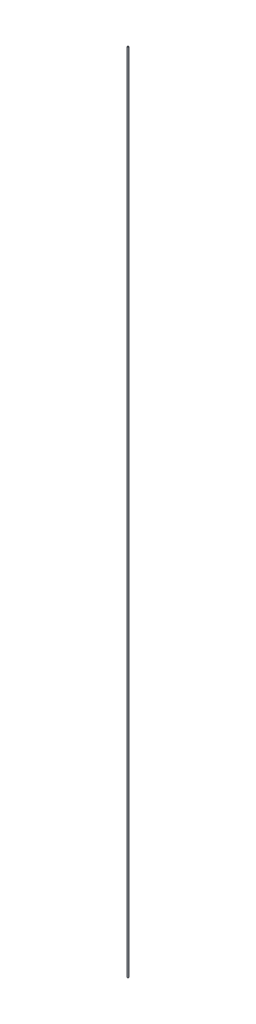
ISO-10303-21;
HEADER;
FILE_DESCRIPTION(('STEP AP214'),'2;1');
FILE_NAME('part.step','',(''),(''),'','','');
FILE_SCHEMA(('AUTOMOTIVE_DESIGN { 1 0 10303 214 1 1 1 1 }'));
ENDSEC;
DATA;
#1=APPLICATION_CONTEXT('core data for automotive mechanical design processes');
#2=APPLICATION_PROTOCOL_DEFINITION('international standard','automotive_design',2000,#1);
#3=PRODUCT_CONTEXT('',#1,'mechanical');
#4=PRODUCT('Part','Part','',(#3));
#5=PRODUCT_RELATED_PRODUCT_CATEGORY('part','',(#4));
#6=PRODUCT_DEFINITION_FORMATION('','',#4);
#7=PRODUCT_DEFINITION_CONTEXT('part definition',#1,'design');
#8=PRODUCT_DEFINITION('design','',#6,#7);
#9=PRODUCT_DEFINITION_SHAPE('','',#8);
#10=(LENGTH_UNIT() NAMED_UNIT(*) SI_UNIT(.MILLI.,.METRE.));
#11=(NAMED_UNIT(*) PLANE_ANGLE_UNIT() SI_UNIT($,.RADIAN.));
#12=(NAMED_UNIT(*) SI_UNIT($,.STERADIAN.) SOLID_ANGLE_UNIT());
#13=UNCERTAINTY_MEASURE_WITH_UNIT(LENGTH_MEASURE(1.E-05),#10,'distance_accuracy_value','');
#14=(GEOMETRIC_REPRESENTATION_CONTEXT(3) GLOBAL_UNCERTAINTY_ASSIGNED_CONTEXT((#13)) GLOBAL_UNIT_ASSIGNED_CONTEXT((#10,
#11,#12)) REPRESENTATION_CONTEXT('',''));
#15=CARTESIAN_POINT('',(0.,0.,0.));
#16=DIRECTION('',(0.,0.,1.));
#17=DIRECTION('',(1.,0.,0.));
#18=AXIS2_PLACEMENT_3D('',#15,#16,#17);
#19=CARTESIAN_POINT('',(0.,1980.,0.));
#20=DIRECTION('',(0.,-1.,0.));
#21=DIRECTION('',(0.,0.,-1.));
#22=AXIS2_PLACEMENT_3D('',#19,#20,#21);
#23=CYLINDRICAL_SURFACE('',#22,1.5);
#24=CARTESIAN_POINT('',(0.,1980.,0.));
#25=DIRECTION('',(0.,1.,0.));
#26=DIRECTION('',(0.,0.,1.));
#27=AXIS2_PLACEMENT_3D('',#24,#25,#26);
#28=CIRCLE('',#27,1.5);
#29=CARTESIAN_POINT('',(0.,1980.,1.5));
#30=VERTEX_POINT('',#29);
#31=EDGE_CURVE('E10',#30,#30,#28,.T.);
#32=ORIENTED_EDGE('',*,*,#31,.F.);
#33=EDGE_LOOP('',(#32));
#34=FACE_BOUND('',#33,.T.);
#35=CARTESIAN_POINT('',(0.,0.,0.));
#36=DIRECTION('',(0.,1.,0.));
#37=DIRECTION('',(0.,0.,1.));
#38=AXIS2_PLACEMENT_3D('',#35,#36,#37);
#39=CIRCLE('',#38,1.5);
#40=CARTESIAN_POINT('',(0.,0.,1.5));
#41=VERTEX_POINT('',#40);
#42=EDGE_CURVE('E33',#41,#41,#39,.T.);
#43=ORIENTED_EDGE('',*,*,#42,.T.);
#44=EDGE_LOOP('',(#43));
#45=FACE_BOUND('',#44,.T.);
#46=ADVANCED_FACE('F30',(#34,#45),#23,.T.);
#47=CARTESIAN_POINT('',(0.,1980.,0.));
#48=DIRECTION('',(0.,1.,0.));
#49=DIRECTION('',(0.,0.,1.));
#50=AXIS2_PLACEMENT_3D('',#47,#48,#49);
#51=PLANE('',#50);
#52=ORIENTED_EDGE('',*,*,#31,.T.);
#53=EDGE_LOOP('',(#52));
#54=FACE_BOUND('',#53,.T.);
#55=ADVANCED_FACE('F45',(#54),#51,.T.);
#56=CARTESIAN_POINT('',(0.,0.,0.));
#57=DIRECTION('',(0.,1.,0.));
#58=DIRECTION('',(0.,0.,1.));
#59=AXIS2_PLACEMENT_3D('',#56,#57,#58);
#60=PLANE('',#59);
#61=ORIENTED_EDGE('',*,*,#42,.F.);
#62=EDGE_LOOP('',(#61));
#63=FACE_BOUND('',#62,.T.);
#64=ADVANCED_FACE('F43',(#63),#60,.F.);
#65=CLOSED_SHELL('',(#46,#55,#64));
#66=MANIFOLD_SOLID_BREP('B2',#65);
#67=ADVANCED_BREP_SHAPE_REPRESENTATION('',(#18,#66),#14);
#68=SHAPE_DEFINITION_REPRESENTATION(#9,#67);
ENDSEC;
END-ISO-10303-21;
